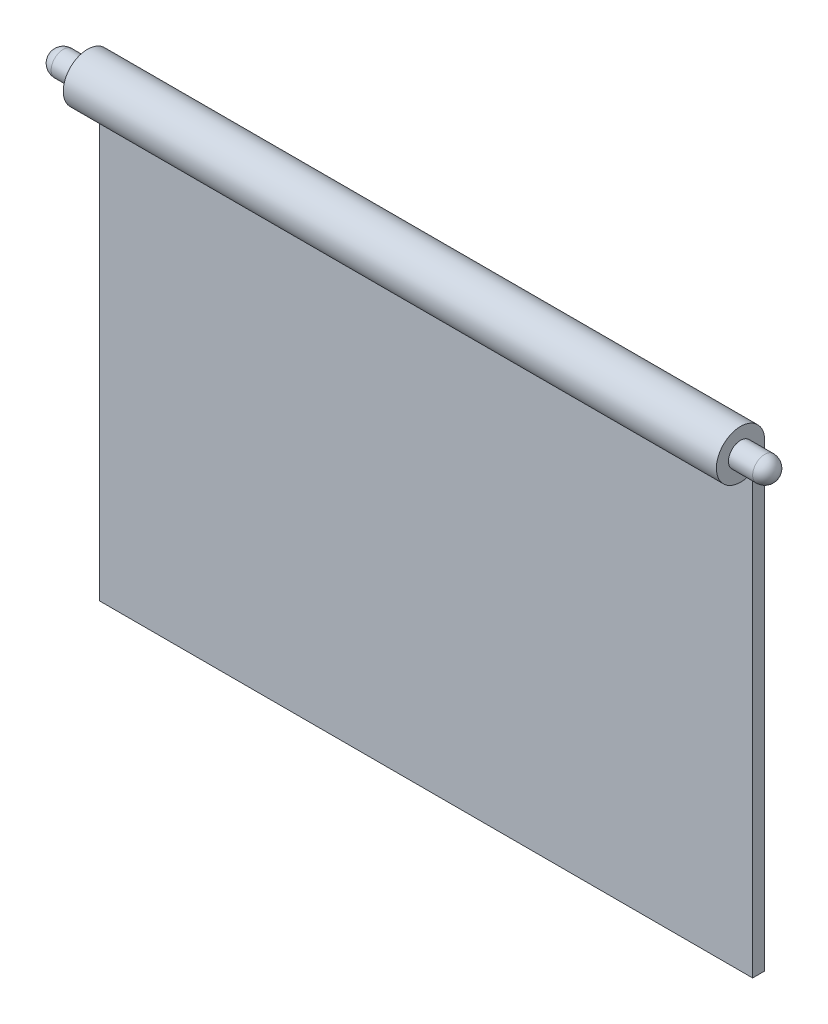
from build123d import *

# Parameters (mm, degrees)
AUFSATZ_LINEAR_AUSTRAGEN1_DEPTH = 135
SKIZZE2_R                       = 5
AUFSATZ_LINEAR_AUSTRAGEN2_DEPTH = 15
VERRUNDUNG1_R                   = 5
VERRUNDUNG1_OF_SPIEGELN1_R      = 5


with BuildPart() as part:
    # Skizze1 → Aufsatz-Linear austragen1 (new, symmetric)
    with BuildSketch(Plane(origin=(0, 0, 0), x_dir=(0, 0, -1), z_dir=(1, 0, 0))):
        with BuildLine():
            Line((5, -8.660254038), (5, -190))
            Line((5, -190), (10, -190))
            Line((10, -190), (10, 0))
            ThreePointArc((10, 0), (-8.660254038, 5), (5, -8.660254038))
        make_face()
    extrude(amount=AUFSATZ_LINEAR_AUSTRAGEN1_DEPTH, both=True)

    # Skizze2 → Aufsatz-Linear austragen2 (add)
    with BuildSketch(Plane(origin=(135, 0, 0), x_dir=(0, 0, -1), z_dir=(1, 0, 0))):
        Circle(SKIZZE2_R)
    aufsatz_linear_austragen2 = extrude(amount=AUFSATZ_LINEAR_AUSTRAGEN2_DEPTH)

    # Verrundung1
    verrundung1_edges = [part.edges().sort_by_distance(p)[0] for p in [
        (150, 0, 5),
    ]]
    fillet(verrundung1_edges, radius=VERRUNDUNG1_R)

    # Spiegeln1: Aufsatz-Linear austragen2 across plane
    add(aufsatz_linear_austragen2.mirror(Plane(origin=(0, 0, 0), x_dir=(0, 0, 1), z_dir=(1, 0, 0))))

    # Verrundung1 of Spiegeln1
    verrundung1_of_spiegeln1_edges = [part.edges().sort_by_distance(p)[0] for p in [
        (-150, 0, 5),
    ]]
    fillet(verrundung1_of_spiegeln1_edges, radius=VERRUNDUNG1_OF_SPIEGELN1_R)

    # Sweep1: sweep along a path in Sketch3
    with BuildLine(Plane(origin=(0, 0, 0), x_dir=(0, 0, -1), z_dir=(1, 0, 0))) as sweep1_path:
        Line((10, -20), (40, -40))
        Line((40, -40), (40, -150))
        Line((40, -150), (10, -170))
    # Sketch2 → Sweep1 (sweep)
    with BuildSketch(Plane(origin=(0, 0, -10), x_dir=(-1, 0, 0), z_dir=(0, 0, -1))):
        Polygon((-10, -20), (10, -20), (7.5, -22.5), (-7.5, -22.5), align=None)
    sweep(path=sweep1_path.line, transition=Transition.RIGHT)


solid = part.part
